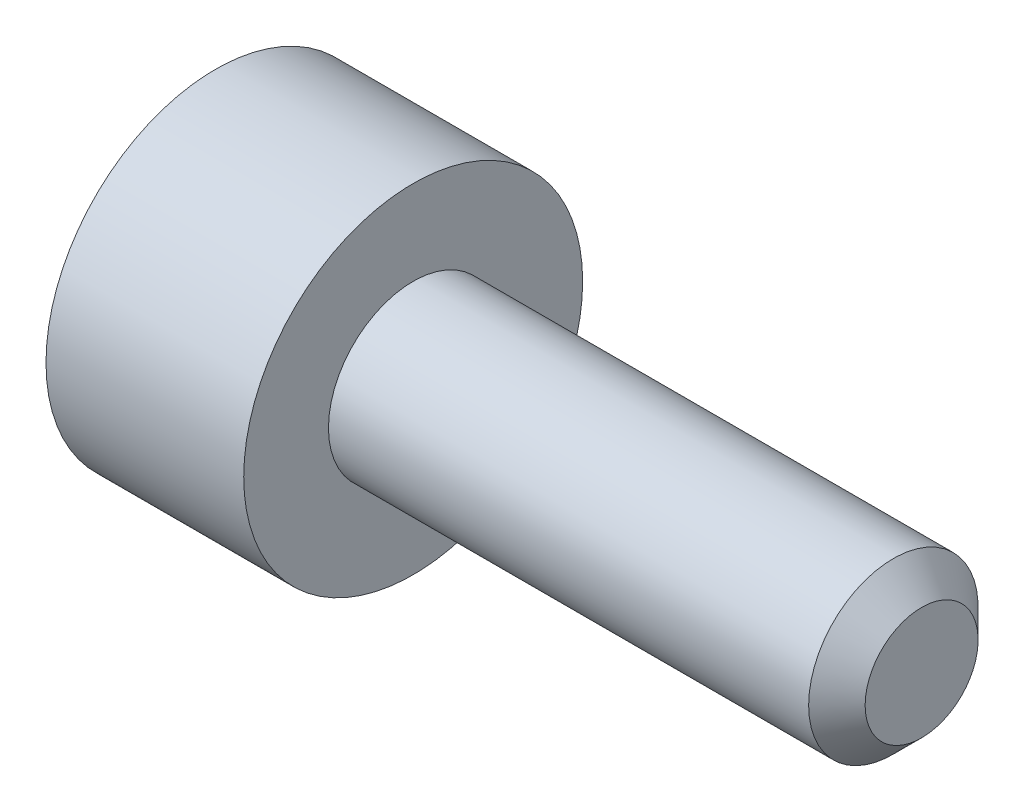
from build123d import *

# Parameters (mm, degrees)
ENL_V_MAT_EXTRU_1_DEPTH = 3
CHANFREIN1_SIZE         = 0.5


with BuildPart() as part:
    # Esquisse1 → R_volution1 (revolve)
    with BuildSketch(Plane.XY, mode=Mode.PRIVATE) as r_volution1_sk:
        Polygon((0, 0), (0, 3), (3.5, 3), (3.5, 1.5), (12.5, 1.5), (12.5, 0), align=None)
    revolve(r_volution1_sk.sketch.rotate(Axis((-12.563624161, 0, 0), (1, 0, 0)), 90), axis=Axis((-12.563624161, 0, 0), (1, 0, 0)))

    # Esquisse2 → Enl_v. mat.-Extru.1 (cut)
    with BuildSketch(Plane.ZY):
        Polygon((1.154700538, 2), (-1.154700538, 2), (-2.309401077, 0), (-1.154700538, -2), (1.154700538, -2), (2.309401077, 0), align=None)
    extrude(amount=-ENL_V_MAT_EXTRU_1_DEPTH, mode=Mode.SUBTRACT)

    # Chanfrein1
    chanfrein1_edges = [part.edges().sort_by_distance(p)[0] for p in [
        (12.5, 0, -1.5),
    ]]
    chamfer(chanfrein1_edges, length=CHANFREIN1_SIZE)


solid = part.part
